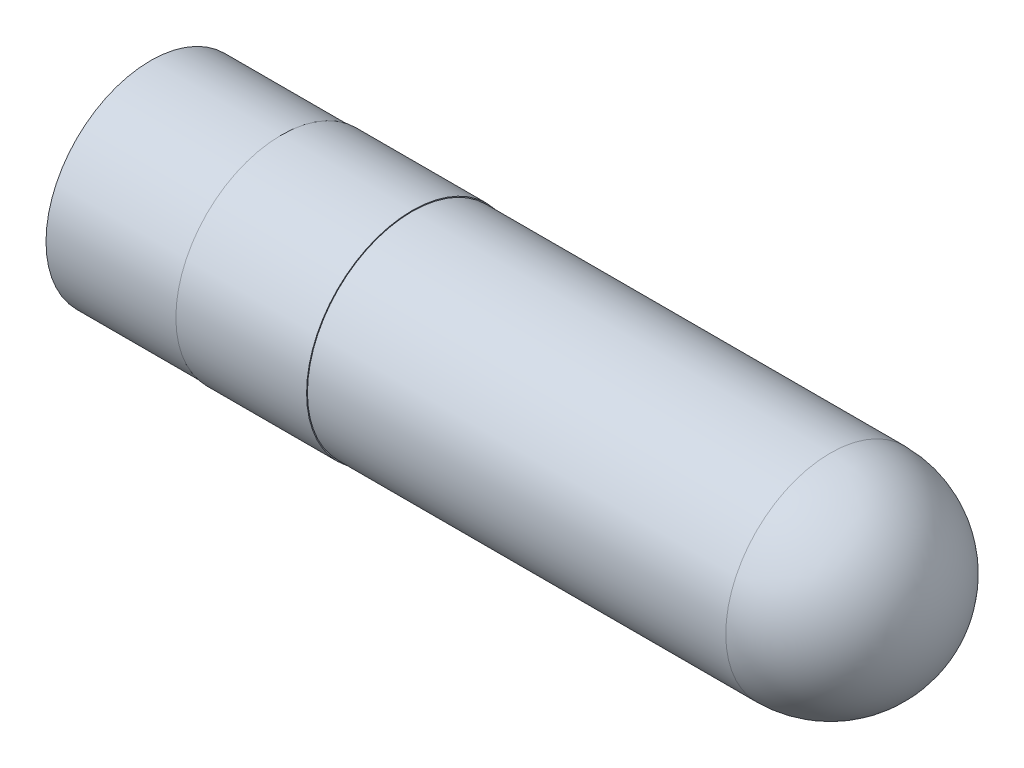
ISO-10303-21;
HEADER;
FILE_DESCRIPTION(('STEP AP214'),'2;1');
FILE_NAME('part.step','',(''),(''),'','','');
FILE_SCHEMA(('AUTOMOTIVE_DESIGN { 1 0 10303 214 1 1 1 1 }'));
ENDSEC;
DATA;
#1=APPLICATION_CONTEXT('core data for automotive mechanical design processes');
#2=APPLICATION_PROTOCOL_DEFINITION('international standard','automotive_design',2000,#1);
#3=PRODUCT_CONTEXT('',#1,'mechanical');
#4=PRODUCT('Part','Part','',(#3));
#5=PRODUCT_RELATED_PRODUCT_CATEGORY('part','',(#4));
#6=PRODUCT_DEFINITION_FORMATION('','',#4);
#7=PRODUCT_DEFINITION_CONTEXT('part definition',#1,'design');
#8=PRODUCT_DEFINITION('design','',#6,#7);
#9=PRODUCT_DEFINITION_SHAPE('','',#8);
#10=(LENGTH_UNIT() NAMED_UNIT(*) SI_UNIT(.MILLI.,.METRE.));
#11=(NAMED_UNIT(*) PLANE_ANGLE_UNIT() SI_UNIT($,.RADIAN.));
#12=(NAMED_UNIT(*) SI_UNIT($,.STERADIAN.) SOLID_ANGLE_UNIT());
#13=UNCERTAINTY_MEASURE_WITH_UNIT(LENGTH_MEASURE(1.E-05),#10,'distance_accuracy_value','');
#14=(GEOMETRIC_REPRESENTATION_CONTEXT(3) GLOBAL_UNCERTAINTY_ASSIGNED_CONTEXT((#13)) GLOBAL_UNIT_ASSIGNED_CONTEXT((#10,
#11,#12)) REPRESENTATION_CONTEXT('',''));
#15=CARTESIAN_POINT('',(0.,0.,0.));
#16=DIRECTION('',(0.,0.,1.));
#17=DIRECTION('',(1.,0.,0.));
#18=AXIS2_PLACEMENT_3D('',#15,#16,#17);
#19=CARTESIAN_POINT('',(-56.5202521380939,0.,0.));
#20=DIRECTION('',(-1.,0.,0.));
#21=DIRECTION('',(0.,0.,1.));
#22=AXIS2_PLACEMENT_3D('',#19,#20,#21);
#23=CYLINDRICAL_SURFACE('',#22,12.);
#24=CARTESIAN_POINT('',(-78.,0.,0.));
#25=DIRECTION('',(-1.,0.,0.));
#26=DIRECTION('',(0.,0.,1.));
#27=AXIS2_PLACEMENT_3D('',#24,#25,#26);
#28=CIRCLE('',#27,12.);
#29=CARTESIAN_POINT('',(-78.,0.,12.));
#30=VERTEX_POINT('',#29);
#31=EDGE_CURVE('E47',#30,#30,#28,.T.);
#32=ORIENTED_EDGE('',*,*,#31,.F.);
#33=EDGE_LOOP('',(#32));
#34=FACE_BOUND('',#33,.T.);
#35=CARTESIAN_POINT('',(-63.,0.,0.));
#36=DIRECTION('',(1.,0.,0.));
#37=DIRECTION('',(0.,0.,-1.));
#38=AXIS2_PLACEMENT_3D('',#35,#36,#37);
#39=CIRCLE('',#38,12.);
#40=CARTESIAN_POINT('',(-63.,0.,-12.));
#41=VERTEX_POINT('',#40);
#42=EDGE_CURVE('E10',#41,#41,#39,.T.);
#43=ORIENTED_EDGE('',*,*,#42,.F.);
#44=EDGE_LOOP('',(#43));
#45=FACE_BOUND('',#44,.T.);
#46=ADVANCED_FACE('F32',(#34,#45),#23,.T.);
#47=CARTESIAN_POINT('',(-78.,12.,0.));
#48=DIRECTION('',(1.,0.,0.));
#49=DIRECTION('',(0.,0.,-1.));
#50=AXIS2_PLACEMENT_3D('',#47,#48,#49);
#51=PLANE('',#50);
#52=CARTESIAN_POINT('',(-78.,0.,0.));
#53=DIRECTION('',(-1.,0.,0.));
#54=DIRECTION('',(0.,0.,1.));
#55=AXIS2_PLACEMENT_3D('',#52,#53,#54);
#56=CIRCLE('',#55,10.8);
#57=CARTESIAN_POINT('',(-78.,0.,10.8));
#58=VERTEX_POINT('',#57);
#59=EDGE_CURVE('E52',#58,#58,#56,.T.);
#60=ORIENTED_EDGE('',*,*,#59,.F.);
#61=EDGE_LOOP('',(#60));
#62=FACE_BOUND('',#61,.T.);
#63=ORIENTED_EDGE('',*,*,#31,.T.);
#64=EDGE_LOOP('',(#63));
#65=FACE_BOUND('',#64,.T.);
#66=ADVANCED_FACE('F82',(#62,#65),#51,.F.);
#67=CARTESIAN_POINT('',(-56.5202521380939,0.,0.));
#68=DIRECTION('',(-1.,0.,0.));
#69=DIRECTION('',(0.,0.,1.));
#70=AXIS2_PLACEMENT_3D('',#67,#68,#69);
#71=CYLINDRICAL_SURFACE('',#70,10.8);
#72=CARTESIAN_POINT('',(0.,0.,0.));
#73=DIRECTION('',(-1.,0.,0.));
#74=DIRECTION('',(0.,0.,1.));
#75=AXIS2_PLACEMENT_3D('',#72,#73,#74);
#76=CIRCLE('',#75,10.8);
#77=CARTESIAN_POINT('',(0.,0.,10.8));
#78=VERTEX_POINT('',#77);
#79=EDGE_CURVE('E55',#78,#78,#76,.T.);
#80=ORIENTED_EDGE('',*,*,#79,.F.);
#81=EDGE_LOOP('',(#80));
#82=FACE_BOUND('',#81,.T.);
#83=ORIENTED_EDGE('',*,*,#59,.T.);
#84=EDGE_LOOP('',(#83));
#85=FACE_BOUND('',#84,.T.);
#86=ADVANCED_FACE('F88',(#82,#85),#71,.F.);
#87=CARTESIAN_POINT('',(0.,0.,0.));
#88=DIRECTION('',(-1.,0.,0.));
#89=DIRECTION('',(0.,1.,0.));
#90=AXIS2_PLACEMENT_3D('',#87,#88,#89);
#91=SPHERICAL_SURFACE('',#90,10.8);
#92=ORIENTED_EDGE('',*,*,#79,.T.);
#93=EDGE_LOOP('',(#92));
#94=FACE_BOUND('',#93,.T.);
#95=ADVANCED_FACE('F79',(#94),#91,.F.);
#96=CARTESIAN_POINT('',(-63.,12.1,0.));
#97=DIRECTION('',(1.,0.,0.));
#98=DIRECTION('',(0.,0.,-1.));
#99=AXIS2_PLACEMENT_3D('',#96,#97,#98);
#100=PLANE('',#99);
#101=ORIENTED_EDGE('',*,*,#42,.T.);
#102=EDGE_LOOP('',(#101));
#103=FACE_BOUND('',#102,.T.);
#104=CARTESIAN_POINT('',(-63.,0.,0.));
#105=DIRECTION('',(-1.,0.,0.));
#106=DIRECTION('',(0.,0.,1.));
#107=AXIS2_PLACEMENT_3D('',#104,#105,#106);
#108=CIRCLE('',#107,12.1);
#109=CARTESIAN_POINT('',(-63.,0.,12.1));
#110=VERTEX_POINT('',#109);
#111=EDGE_CURVE('E61',#110,#110,#108,.T.);
#112=ORIENTED_EDGE('',*,*,#111,.T.);
#113=EDGE_LOOP('',(#112));
#114=FACE_BOUND('',#113,.T.);
#115=ADVANCED_FACE('F65',(#103,#114),#100,.F.);
#116=CARTESIAN_POINT('',(-48.,12.1,0.));
#117=DIRECTION('',(-1.,0.,0.));
#118=DIRECTION('',(0.,0.,1.));
#119=AXIS2_PLACEMENT_3D('',#116,#117,#118);
#120=PLANE('',#119);
#121=CARTESIAN_POINT('',(-48.,0.,0.));
#122=DIRECTION('',(-1.,0.,0.));
#123=DIRECTION('',(0.,0.,1.));
#124=AXIS2_PLACEMENT_3D('',#121,#122,#123);
#125=CIRCLE('',#124,12.1);
#126=CARTESIAN_POINT('',(-48.,0.,12.1));
#127=VERTEX_POINT('',#126);
#128=EDGE_CURVE('E58',#127,#127,#125,.T.);
#129=ORIENTED_EDGE('',*,*,#128,.F.);
#130=EDGE_LOOP('',(#129));
#131=FACE_BOUND('',#130,.T.);
#132=CARTESIAN_POINT('',(-48.,0.,0.));
#133=DIRECTION('',(-1.,0.,0.));
#134=DIRECTION('',(0.,0.,1.));
#135=AXIS2_PLACEMENT_3D('',#132,#133,#134);
#136=CIRCLE('',#135,12.);
#137=CARTESIAN_POINT('',(-48.,0.,12.));
#138=VERTEX_POINT('',#137);
#139=EDGE_CURVE('E39',#138,#138,#136,.T.);
#140=ORIENTED_EDGE('',*,*,#139,.T.);
#141=EDGE_LOOP('',(#140));
#142=FACE_BOUND('',#141,.T.);
#143=ADVANCED_FACE('F70',(#131,#142),#120,.F.);
#144=CARTESIAN_POINT('',(-88.6544143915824,0.,0.));
#145=DIRECTION('',(-1.,0.,0.));
#146=DIRECTION('',(0.,0.,1.));
#147=AXIS2_PLACEMENT_3D('',#144,#145,#146);
#148=CYLINDRICAL_SURFACE('',#147,12.1);
#149=ORIENTED_EDGE('',*,*,#111,.F.);
#150=EDGE_LOOP('',(#149));
#151=FACE_BOUND('',#150,.T.);
#152=ORIENTED_EDGE('',*,*,#128,.T.);
#153=EDGE_LOOP('',(#152));
#154=FACE_BOUND('',#153,.T.);
#155=ADVANCED_FACE('F67',(#151,#154),#148,.T.);
#156=CARTESIAN_POINT('',(0.,0.,0.));
#157=DIRECTION('',(-1.,0.,0.));
#158=DIRECTION('',(0.,1.,0.));
#159=AXIS2_PLACEMENT_3D('',#156,#157,#158);
#160=SPHERICAL_SURFACE('',#159,12.);
#161=CARTESIAN_POINT('',(0.,0.,0.));
#162=DIRECTION('',(-1.,0.,0.));
#163=DIRECTION('',(0.,0.,1.));
#164=AXIS2_PLACEMENT_3D('',#161,#162,#163);
#165=CIRCLE('',#164,12.);
#166=CARTESIAN_POINT('',(0.,0.,12.));
#167=VERTEX_POINT('',#166);
#168=EDGE_CURVE('E43',#167,#167,#165,.T.);
#169=ORIENTED_EDGE('',*,*,#168,.F.);
#170=EDGE_LOOP('',(#169));
#171=FACE_BOUND('',#170,.T.);
#172=ADVANCED_FACE('F34',(#171),#160,.T.);
#173=ORIENTED_EDGE('',*,*,#168,.T.);
#174=EDGE_LOOP('',(#173));
#175=FACE_BOUND('',#174,.T.);
#176=ORIENTED_EDGE('',*,*,#139,.F.);
#177=EDGE_LOOP('',(#176));
#178=FACE_BOUND('',#177,.T.);
#179=ADVANCED_FACE('F84',(#175,#178),#23,.T.);
#180=CLOSED_SHELL('',(#46,#66,#86,#95,#115,#143,#155,#172,#179));
#181=MANIFOLD_SOLID_BREP('B2',#180);
#182=ADVANCED_BREP_SHAPE_REPRESENTATION('',(#18,#181),#14);
#183=SHAPE_DEFINITION_REPRESENTATION(#9,#182);
ENDSEC;
END-ISO-10303-21;
